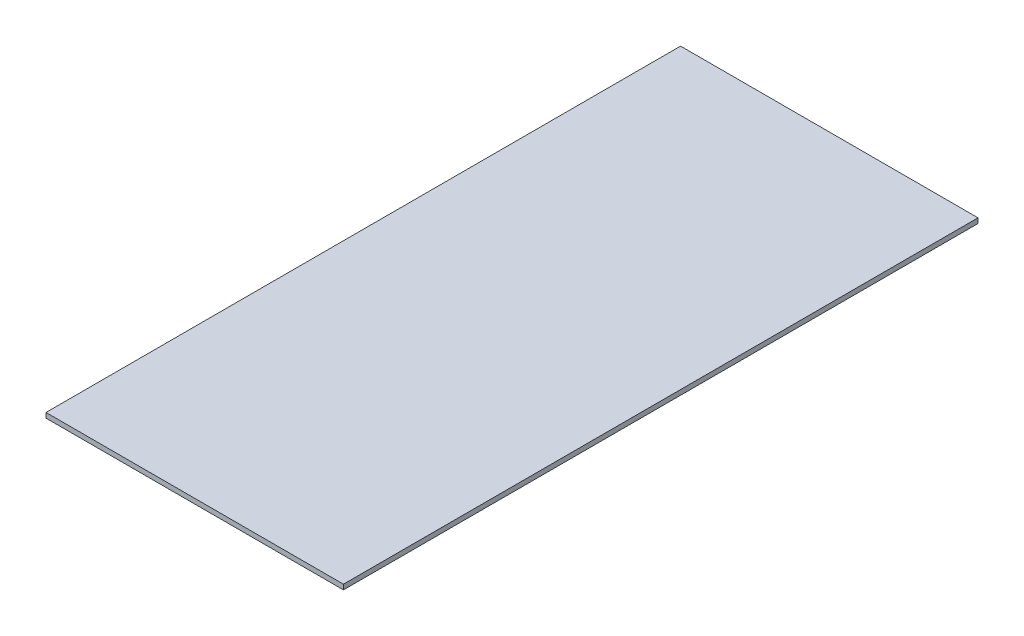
from build123d import *

# Parameters (mm, degrees)
SKETCH1_W           = 60
SKETCH1_H           = 128
BOSS_EXTRUDE1_DEPTH = 1


with BuildPart() as part:
    # Sketch1 → Boss-Extrude1 (new body)
    with BuildSketch(Plane(origin=(0, 0, 0), x_dir=(1, 0, 0), z_dir=(0, 1, 0))):
        with Locations((30, 64)):
            Rectangle(SKETCH1_W, SKETCH1_H)
    extrude(amount=BOSS_EXTRUDE1_DEPTH)


solid = part.part
